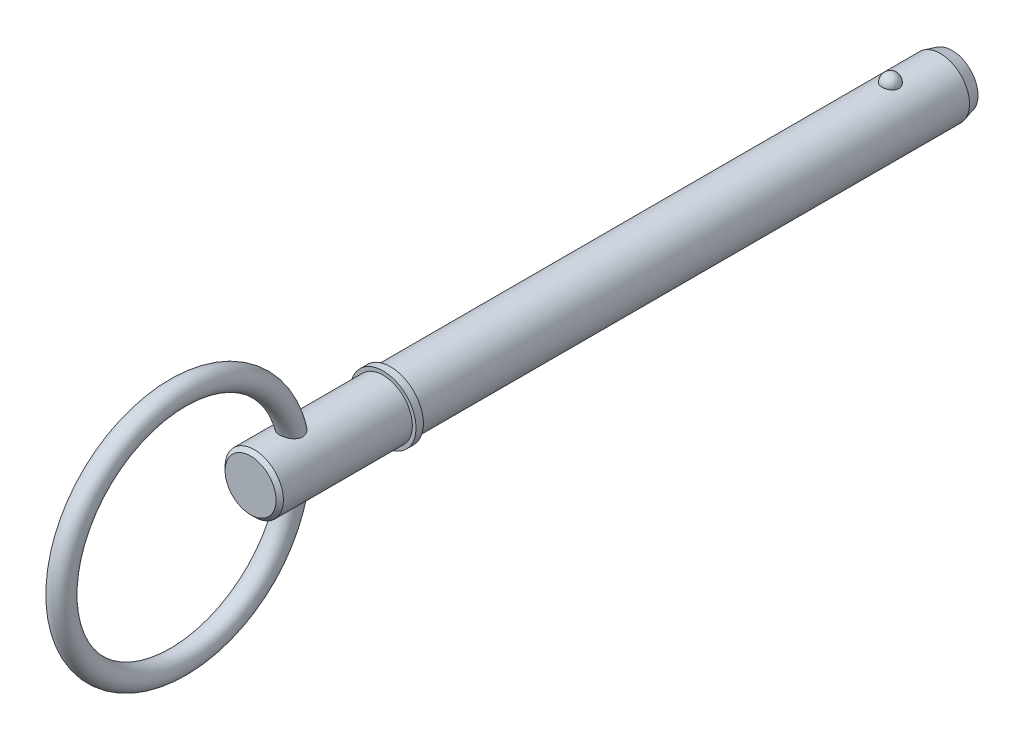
ISO-10303-21;
HEADER;
FILE_DESCRIPTION(('STEP AP214'),'2;1');
FILE_NAME('part.step','',(''),(''),'','','');
FILE_SCHEMA(('AUTOMOTIVE_DESIGN { 1 0 10303 214 1 1 1 1 }'));
ENDSEC;
DATA;
#1=APPLICATION_CONTEXT('core data for automotive mechanical design processes');
#2=APPLICATION_PROTOCOL_DEFINITION('international standard','automotive_design',2000,#1);
#3=PRODUCT_CONTEXT('',#1,'mechanical');
#4=PRODUCT('Part','Part','',(#3));
#5=PRODUCT_RELATED_PRODUCT_CATEGORY('part','',(#4));
#6=PRODUCT_DEFINITION_FORMATION('','',#4);
#7=PRODUCT_DEFINITION_CONTEXT('part definition',#1,'design');
#8=PRODUCT_DEFINITION('design','',#6,#7);
#9=PRODUCT_DEFINITION_SHAPE('','',#8);
#10=(LENGTH_UNIT() NAMED_UNIT(*) SI_UNIT(.MILLI.,.METRE.));
#11=(NAMED_UNIT(*) PLANE_ANGLE_UNIT() SI_UNIT($,.RADIAN.));
#12=(NAMED_UNIT(*) SI_UNIT($,.STERADIAN.) SOLID_ANGLE_UNIT());
#13=UNCERTAINTY_MEASURE_WITH_UNIT(LENGTH_MEASURE(1.E-05),#10,'distance_accuracy_value','');
#14=(GEOMETRIC_REPRESENTATION_CONTEXT(3) GLOBAL_UNCERTAINTY_ASSIGNED_CONTEXT((#13)) GLOBAL_UNIT_ASSIGNED_CONTEXT((#10,
#11,#12)) REPRESENTATION_CONTEXT('',''));
#15=CARTESIAN_POINT('',(0.,0.,0.));
#16=DIRECTION('',(0.,0.,1.));
#17=DIRECTION('',(1.,0.,0.));
#18=AXIS2_PLACEMENT_3D('',#15,#16,#17);
#19=CARTESIAN_POINT('',(0.,0.,66.9));
#20=DIRECTION('',(0.,0.,-1.));
#21=DIRECTION('',(-1.,0.,0.));
#22=AXIS2_PLACEMENT_3D('',#19,#20,#21);
#23=CYLINDRICAL_SURFACE('',#22,3.97);
#24=CARTESIAN_POINT('',(1.13787398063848,3.80343828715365,-1.15));
#25=CARTESIAN_POINT('',(1.13787307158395,3.80343910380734,-1.0857397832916));
#26=CARTESIAN_POINT('',(1.13264657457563,3.80501406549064,-1.02146820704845));
#27=CARTESIAN_POINT('',(1.11186534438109,3.81113760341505,-0.894749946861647));
#28=CARTESIAN_POINT('',(1.09630734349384,3.81568712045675,-0.832303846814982));
#29=CARTESIAN_POINT('',(1.05525533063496,3.82724281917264,-0.711040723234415));
#30=CARTESIAN_POINT('',(1.02976565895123,3.83424792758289,-0.652222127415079));
#31=CARTESIAN_POINT('',(0.969477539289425,3.84993235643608,-0.53981446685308));
#32=CARTESIAN_POINT('',(0.934679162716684,3.85861166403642,-0.486225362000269));
#33=CARTESIAN_POINT('',(0.856427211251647,3.87673176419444,-0.385470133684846));
#34=CARTESIAN_POINT('',(0.812928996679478,3.88617632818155,-0.338339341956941));
#35=CARTESIAN_POINT('',(0.718506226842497,3.90473543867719,-0.252134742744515));
#36=CARTESIAN_POINT('',(0.667581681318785,3.91384998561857,-0.213060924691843));
#37=CARTESIAN_POINT('',(0.559829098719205,3.93070626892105,-0.144169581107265));
#38=CARTESIAN_POINT('',(0.503019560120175,3.93845211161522,-0.114324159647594));
#39=CARTESIAN_POINT('',(0.384957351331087,3.95173781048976,-0.0645874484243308));
#40=CARTESIAN_POINT('',(0.323705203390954,3.95727792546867,-0.0446949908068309));
#41=CARTESIAN_POINT('',(0.1997490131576,3.96544869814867,-0.0157294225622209));
#42=CARTESIAN_POINT('',(0.137095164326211,3.96813298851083,-0.00645660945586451));
#43=CARTESIAN_POINT('',(0.0110617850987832,3.97048461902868,0.00167939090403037));
#44=CARTESIAN_POINT('',(-0.0523176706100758,3.97015226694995,0.000543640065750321));
#45=CARTESIAN_POINT('',(-0.176983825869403,3.96653606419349,-0.0120046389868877));
#46=CARTESIAN_POINT('',(-0.238287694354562,3.96329719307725,-0.0232605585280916));
#47=CARTESIAN_POINT('',(-0.358077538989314,3.95427494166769,-0.0555133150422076));
#48=CARTESIAN_POINT('',(-0.41656346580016,3.94849151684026,-0.0765103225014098));
#49=CARTESIAN_POINT('',(-0.529474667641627,3.9349475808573,-0.127824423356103));
#50=CARTESIAN_POINT('',(-0.583873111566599,3.92717527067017,-0.158197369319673));
#51=CARTESIAN_POINT('',(-0.686796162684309,3.9104901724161,-0.227402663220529));
#52=CARTESIAN_POINT('',(-0.735320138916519,3.90157726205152,-0.266235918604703));
#53=CARTESIAN_POINT('',(-0.826197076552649,3.88336108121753,-0.352210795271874));
#54=CARTESIAN_POINT('',(-0.868404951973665,3.87405356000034,-0.399504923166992));
#55=CARTESIAN_POINT('',(-0.944393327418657,3.85623507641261,-0.500572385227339));
#56=CARTESIAN_POINT('',(-0.978173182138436,3.84772417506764,-0.554346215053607));
#57=CARTESIAN_POINT('',(-1.036841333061,3.83233550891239,-0.667624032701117));
#58=CARTESIAN_POINT('',(-1.06161430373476,3.82547928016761,-0.727190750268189));
#59=CARTESIAN_POINT('',(-1.1010562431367,3.81431496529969,-0.849806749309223));
#60=CARTESIAN_POINT('',(-1.11572551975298,3.81000680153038,-0.912855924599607));
#61=CARTESIAN_POINT('',(-1.13455293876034,3.80444307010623,-1.04035299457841));
#62=CARTESIAN_POINT('',(-1.13875701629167,3.80317416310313,-1.10479351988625));
#63=CARTESIAN_POINT('',(-1.13668244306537,3.80379469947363,-1.23348881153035));
#64=CARTESIAN_POINT('',(-1.13040410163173,3.80568404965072,-1.29774358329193));
#65=CARTESIAN_POINT('',(-1.10758455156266,3.81238701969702,-1.42388263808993));
#66=CARTESIAN_POINT('',(-1.09109911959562,3.81718474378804,-1.48577787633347));
#67=CARTESIAN_POINT('',(-1.04831897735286,3.82915360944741,-1.6058363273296));
#68=CARTESIAN_POINT('',(-1.02202385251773,3.83632485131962,-1.66399938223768));
#69=CARTESIAN_POINT('',(-0.960087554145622,3.85229234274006,-1.77531672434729));
#70=CARTESIAN_POINT('',(-0.924393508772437,3.86109769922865,-1.82844028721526));
#71=CARTESIAN_POINT('',(-0.844617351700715,3.87932868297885,-1.92784641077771));
#72=CARTESIAN_POINT('',(-0.800534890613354,3.88875433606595,-1.97412868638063));
#73=CARTESIAN_POINT('',(-0.704909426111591,3.90722138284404,-2.05875748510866));
#74=CARTESIAN_POINT('',(-0.653336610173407,3.91626104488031,-2.09707073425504));
#75=CARTESIAN_POINT('',(-0.544251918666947,3.93290335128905,-2.16444159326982));
#76=CARTESIAN_POINT('',(-0.486740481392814,3.94050610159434,-2.19349988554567));
#77=CARTESIAN_POINT('',(-0.368186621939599,3.95333328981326,-2.24120607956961));
#78=CARTESIAN_POINT('',(-0.307200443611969,3.9585876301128,-2.25998559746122));
#79=CARTESIAN_POINT('',(-0.182787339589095,3.96627905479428,-2.28716436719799));
#80=CARTESIAN_POINT('',(-0.119360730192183,3.96871650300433,-2.29556495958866));
#81=CARTESIAN_POINT('',(0.00676344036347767,3.97048518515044,-2.30167748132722));
#82=CARTESIAN_POINT('',(0.0694499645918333,3.96987797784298,-2.299601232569));
#83=CARTESIAN_POINT('',(0.193555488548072,3.96576491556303,-2.28530777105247));
#84=CARTESIAN_POINT('',(0.254974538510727,3.96225917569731,-2.27309096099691));
#85=CARTESIAN_POINT('',(0.374550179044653,3.95274547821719,-2.2389384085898));
#86=CARTESIAN_POINT('',(0.432719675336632,3.94674835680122,-2.2170447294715));
#87=CARTESIAN_POINT('',(0.544514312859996,3.93288448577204,-2.16414952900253));
#88=CARTESIAN_POINT('',(0.598139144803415,3.92501760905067,-2.13314738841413));
#89=CARTESIAN_POINT('',(0.700284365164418,3.90809781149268,-2.06228741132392));
#90=CARTESIAN_POINT('',(0.748708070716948,3.89902775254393,-2.02229434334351));
#91=CARTESIAN_POINT('',(0.838215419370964,3.88077133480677,-1.93481443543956));
#92=CARTESIAN_POINT('',(0.879297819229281,3.87158495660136,-1.88732632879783));
#93=CARTESIAN_POINT('',(0.953804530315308,3.85391414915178,-1.78516284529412));
#94=CARTESIAN_POINT('',(0.987071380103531,3.8454460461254,-1.73036973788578));
#95=CARTESIAN_POINT('',(1.04410491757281,3.83035507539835,-1.61582422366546));
#96=CARTESIAN_POINT('',(1.06787445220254,3.82373165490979,-1.5560733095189));
#97=CARTESIAN_POINT('',(1.10358064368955,3.813570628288,-1.43904746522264));
#98=CARTESIAN_POINT('',(1.11641754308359,3.80980198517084,-1.38206535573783));
#99=CARTESIAN_POINT('',(1.13356451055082,3.80473547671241,-1.26672526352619));
#100=CARTESIAN_POINT('',(1.13787480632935,3.80343754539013,-1.20836731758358));
#101=CARTESIAN_POINT('',(1.13787398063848,3.80343828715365,-1.15));
#102=B_SPLINE_CURVE_WITH_KNOTS('',3,(#24,#25,#26,#27,#28,#29,#30,#31,#32,#33,#34,#35,#36,#37,
#38,#39,#40,#41,#42,#43,#44,#45,#46,#47,#48,#49,#50,#51,#52,#53,#54,#55,#56,#57,#58,#59,#60,#61,
#62,#63,#64,#65,#66,#67,#68,#69,#70,#71,#72,#73,#74,#75,#76,#77,#78,#79,#80,#81,#82,#83,#84,#85,
#86,#87,#88,#89,#90,#91,#92,#93,#94,#95,#96,#97,#98,#99,#100,#101),.UNSPECIFIED.,.T.,.F.,(4,2,2,
2,2,2,2,2,2,2,2,2,2,2,2,2,2,2,2,2,2,2,2,2,2,2,2,2,2,2,2,2,2,2,2,2,2,2,4),(0.,0.192571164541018,
0.385203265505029,0.577751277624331,0.770297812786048,0.963858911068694,1.15741975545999,
1.35038964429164,1.54333688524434,1.73259288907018,1.92182958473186,2.10818732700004,
2.2945483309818,2.48204164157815,2.66955507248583,2.86087083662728,3.05220124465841,
3.24590171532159,3.43959628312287,3.63243915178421,3.82527632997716,4.01706893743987,
4.20886965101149,4.40177324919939,4.59468488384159,4.78838651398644,4.9820738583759,
5.17321934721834,5.36434014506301,5.55161251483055,5.7388774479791,5.92533626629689,
6.11180776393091,6.30129785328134,6.49082000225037,6.68388392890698,6.87688993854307,
7.05180628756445,7.22671796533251),.UNSPECIFIED.);
#103=CARTESIAN_POINT('',(1.13787398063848,3.80343828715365,-1.15));
#104=VERTEX_POINT('',#103);
#105=EDGE_CURVE('E102',#104,#104,#102,.T.);
#106=ORIENTED_EDGE('',*,*,#105,.T.);
#107=EDGE_LOOP('',(#106));
#108=FACE_BOUND('',#107,.T.);
#109=CARTESIAN_POINT('',(0.,0.,-7.94399999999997));
#110=DIRECTION('',(0.,0.,-1.));
#111=DIRECTION('',(-1.,0.,0.));
#112=AXIS2_PLACEMENT_3D('',#109,#110,#111);
#113=CIRCLE('',#112,3.97);
#114=CARTESIAN_POINT('',(-3.97,0.,-7.94399999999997));
#115=VERTEX_POINT('',#114);
#116=EDGE_CURVE('E110',#115,#115,#113,.F.);
#117=ORIENTED_EDGE('',*,*,#116,.T.);
#118=EDGE_LOOP('',(#117));
#119=FACE_BOUND('',#118,.T.);
#120=CARTESIAN_POINT('',(0.,0.,66.9));
#121=DIRECTION('',(0.,0.,1.));
#122=DIRECTION('',(1.,0.,0.));
#123=AXIS2_PLACEMENT_3D('',#120,#121,#122);
#124=CIRCLE('',#123,3.97);
#125=CARTESIAN_POINT('',(3.97,0.,66.9));
#126=VERTEX_POINT('',#125);
#127=EDGE_CURVE('E108',#126,#126,#124,.T.);
#128=ORIENTED_EDGE('',*,*,#127,.F.);
#129=EDGE_LOOP('',(#128));
#130=FACE_BOUND('',#129,.T.);
#131=ADVANCED_FACE('F39',(#108,#119,#130),#23,.T.);
#132=CARTESIAN_POINT('',(0.,0.,-9.53));
#133=DIRECTION('',(0.,0.,-1.));
#134=DIRECTION('',(-1.,0.,0.));
#135=AXIS2_PLACEMENT_3D('',#132,#133,#134);
#136=PLANE('',#135);
#137=CARTESIAN_POINT('',(0.,0.,-9.53));
#138=DIRECTION('',(0.,0.,-1.));
#139=DIRECTION('',(-1.,0.,0.));
#140=AXIS2_PLACEMENT_3D('',#137,#138,#139);
#141=CIRCLE('',#140,3.54503258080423);
#142=CARTESIAN_POINT('',(-3.54503258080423,0.,-9.53));
#143=VERTEX_POINT('',#142);
#144=EDGE_CURVE('E142',#143,#143,#141,.T.);
#145=ORIENTED_EDGE('',*,*,#144,.T.);
#146=EDGE_LOOP('',(#145));
#147=FACE_BOUND('',#146,.T.);
#148=ADVANCED_FACE('F88',(#147),#136,.T.);
#149=CARTESIAN_POINT('',(0.,0.,-9.53));
#150=DIRECTION('',(0.,0.,1.));
#151=DIRECTION('',(1.,0.,0.));
#152=AXIS2_PLACEMENT_3D('',#149,#150,#151);
#153=CONICAL_SURFACE('',#152,3.54503258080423,0.261799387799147);
#154=ORIENTED_EDGE('',*,*,#116,.F.);
#155=EDGE_LOOP('',(#154));
#156=FACE_BOUND('',#155,.T.);
#157=ORIENTED_EDGE('',*,*,#144,.F.);
#158=EDGE_LOOP('',(#157));
#159=FACE_BOUND('',#158,.T.);
#160=ADVANCED_FACE('F94',(#156,#159),#153,.T.);
#161=CARTESIAN_POINT('',(0.,3.97,-1.15));
#162=DIRECTION('',(0.,1.,0.));
#163=DIRECTION('',(0.,0.,-1.));
#164=AXIS2_PLACEMENT_3D('',#161,#162,#163);
#165=SPHERICAL_SURFACE('',#164,1.15);
#166=ORIENTED_EDGE('',*,*,#105,.F.);
#167=EDGE_LOOP('',(#166));
#168=FACE_BOUND('',#167,.T.);
#169=ADVANCED_FACE('F113',(#168),#165,.T.);
#170=CARTESIAN_POINT('',(0.,0.,66.9));
#171=DIRECTION('',(0.,0.,-1.));
#172=DIRECTION('',(-1.,0.,0.));
#173=AXIS2_PLACEMENT_3D('',#170,#171,#172);
#174=PLANE('',#173);
#175=ORIENTED_EDGE('',*,*,#127,.T.);
#176=EDGE_LOOP('',(#175));
#177=FACE_BOUND('',#176,.T.);
#178=CARTESIAN_POINT('',(0.,0.,66.9));
#179=DIRECTION('',(0.,0.,-1.));
#180=DIRECTION('',(-1.,0.,0.));
#181=AXIS2_PLACEMENT_3D('',#178,#179,#180);
#182=CIRCLE('',#181,4.47);
#183=CARTESIAN_POINT('',(-4.47,0.,66.9));
#184=VERTEX_POINT('',#183);
#185=EDGE_CURVE('E109',#184,#184,#182,.T.);
#186=ORIENTED_EDGE('',*,*,#185,.T.);
#187=EDGE_LOOP('',(#186));
#188=FACE_BOUND('',#187,.T.);
#189=ADVANCED_FACE('F117',(#177,#188),#174,.T.);
#190=CARTESIAN_POINT('',(0.,0.,33.7287874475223));
#191=DIRECTION('',(0.,0.,-1.));
#192=DIRECTION('',(-1.,0.,0.));
#193=AXIS2_PLACEMENT_3D('',#190,#191,#192);
#194=CYLINDRICAL_SURFACE('',#193,4.47);
#195=CARTESIAN_POINT('',(0.,0.,67.9));
#196=DIRECTION('',(0.,0.,-1.));
#197=DIRECTION('',(-1.,0.,0.));
#198=AXIS2_PLACEMENT_3D('',#195,#196,#197);
#199=CIRCLE('',#198,4.47);
#200=CARTESIAN_POINT('',(-4.47,0.,67.9));
#201=VERTEX_POINT('',#200);
#202=EDGE_CURVE('E134',#201,#201,#199,.T.);
#203=ORIENTED_EDGE('',*,*,#202,.T.);
#204=EDGE_LOOP('',(#203));
#205=FACE_BOUND('',#204,.T.);
#206=ORIENTED_EDGE('',*,*,#185,.F.);
#207=EDGE_LOOP('',(#206));
#208=FACE_BOUND('',#207,.T.);
#209=ADVANCED_FACE('F121',(#205,#208),#194,.T.);
#210=CARTESIAN_POINT('',(0.,4.47,67.9));
#211=DIRECTION('',(0.,0.,1.));
#212=DIRECTION('',(1.,0.,0.));
#213=AXIS2_PLACEMENT_3D('',#210,#211,#212);
#214=PLANE('',#213);
#215=CARTESIAN_POINT('',(0.,0.,67.9));
#216=DIRECTION('',(0.,0.,1.));
#217=DIRECTION('',(1.,0.,0.));
#218=AXIS2_PLACEMENT_3D('',#215,#216,#217);
#219=CIRCLE('',#218,3.97);
#220=CARTESIAN_POINT('',(3.97,0.,67.9));
#221=VERTEX_POINT('',#220);
#222=EDGE_CURVE('E112',#221,#221,#219,.T.);
#223=ORIENTED_EDGE('',*,*,#222,.F.);
#224=EDGE_LOOP('',(#223));
#225=FACE_BOUND('',#224,.T.);
#226=ORIENTED_EDGE('',*,*,#202,.F.);
#227=EDGE_LOOP('',(#226));
#228=FACE_BOUND('',#227,.T.);
#229=ADVANCED_FACE('F85',(#225,#228),#214,.T.);
#230=CARTESIAN_POINT('',(0.,0.,85.95));
#231=DIRECTION('',(0.,0.,-1.));
#232=DIRECTION('',(-1.,0.,0.));
#233=AXIS2_PLACEMENT_3D('',#230,#231,#232);
#234=CYLINDRICAL_SURFACE('',#233,3.97);
#235=CARTESIAN_POINT('',(-0.740636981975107,-3.90030215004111,79.0942081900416));
#236=CARTESIAN_POINT('',(-0.667733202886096,-3.91414543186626,79.054930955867));
#237=CARTESIAN_POINT('',(-0.591347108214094,-3.92651643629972,79.0215983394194));
#238=CARTESIAN_POINT('',(-0.433709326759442,-3.94703799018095,78.9675410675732));
#239=CARTESIAN_POINT('',(-0.352458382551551,-3.95518918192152,78.9468144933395));
#240=CARTESIAN_POINT('',(-0.187320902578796,-3.96644185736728,78.9184263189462));
#241=CARTESIAN_POINT('',(-0.103433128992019,-3.9695409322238,78.9107709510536));
#242=CARTESIAN_POINT('',(0.0645297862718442,-3.97036376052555,78.9087268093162));
#243=CARTESIAN_POINT('',(0.148604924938,-3.96808759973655,78.9143378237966));
#244=CARTESIAN_POINT('',(0.313967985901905,-3.95842655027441,78.9386101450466));
#245=CARTESIAN_POINT('',(0.395270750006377,-3.95107581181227,78.9571842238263));
#246=CARTESIAN_POINT('',(0.553418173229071,-3.93204472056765,79.0068699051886));
#247=CARTESIAN_POINT('',(0.63026242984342,-3.92036397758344,79.0379826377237));
#248=CARTESIAN_POINT('',(0.777983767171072,-3.89375421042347,79.1123739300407));
#249=CARTESIAN_POINT('',(0.848809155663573,-3.8788003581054,79.1557462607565));
#250=CARTESIAN_POINT('',(0.981880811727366,-3.84727071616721,79.2536515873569));
#251=CARTESIAN_POINT('',(1.04412630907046,-3.83069478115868,79.3081855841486));
#252=CARTESIAN_POINT('',(1.15846819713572,-3.79768496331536,79.4274397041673));
#253=CARTESIAN_POINT('',(1.21053047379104,-3.78125172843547,79.4921927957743));
#254=CARTESIAN_POINT('',(1.30266807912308,-3.75050988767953,79.6301698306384));
#255=CARTESIAN_POINT('',(1.34274789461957,-3.73620048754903,79.7033905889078));
#256=CARTESIAN_POINT('',(1.40857853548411,-3.71187334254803,79.8536278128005));
#257=CARTESIAN_POINT('',(1.43477198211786,-3.70172571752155,79.9304292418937));
#258=CARTESIAN_POINT('',(1.47426417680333,-3.68617713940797,80.0877211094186));
#259=CARTESIAN_POINT('',(1.48756557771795,-3.68077520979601,80.168210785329));
#260=CARTESIAN_POINT('',(1.5011302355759,-3.67526295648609,80.3282774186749));
#261=CARTESIAN_POINT('',(1.50172918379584,-3.67501639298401,80.4078221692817));
#262=CARTESIAN_POINT('',(1.4912869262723,-3.67926498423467,80.5660010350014));
#263=CARTESIAN_POINT('',(1.48024221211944,-3.68376156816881,80.6446348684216));
#264=CARTESIAN_POINT('',(1.44631002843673,-3.69722026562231,80.8039961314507));
#265=CARTESIAN_POINT('',(1.42273446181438,-3.7064405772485,80.8845537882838));
#266=CARTESIAN_POINT('',(1.36440745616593,-3.72830487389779,81.0410229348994));
#267=CARTESIAN_POINT('',(1.32965006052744,-3.74095068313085,81.1169319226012));
#268=CARTESIAN_POINT('',(1.244983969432,-3.77003365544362,81.2715893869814));
#269=CARTESIAN_POINT('',(1.19374759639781,-3.78674477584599,81.3495625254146));
#270=CARTESIAN_POINT('',(1.07927226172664,-3.82094743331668,81.496060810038));
#271=CARTESIAN_POINT('',(1.0160234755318,-3.83843960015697,81.5645781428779));
#272=CARTESIAN_POINT('',(0.875824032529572,-3.87288453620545,81.6922425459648));
#273=CARTESIAN_POINT('',(0.798445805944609,-3.88979192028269,81.7509375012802));
#274=CARTESIAN_POINT('',(0.633271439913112,-3.92005992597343,81.8524486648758));
#275=CARTESIAN_POINT('',(0.54549210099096,-3.9334261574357,81.8952900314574));
#276=CARTESIAN_POINT('',(0.374503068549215,-3.9531041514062,81.9573026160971));
#277=CARTESIAN_POINT('',(0.29225018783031,-3.96011991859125,81.9788718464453));
#278=CARTESIAN_POINT('',(0.124887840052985,-3.96891507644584,82.0058171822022));
#279=CARTESIAN_POINT('',(0.0397822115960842,-3.97070123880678,82.011214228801));
#280=CARTESIAN_POINT('',(-0.116598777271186,-3.96893737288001,82.0058414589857));
#281=CARTESIAN_POINT('',(-0.187977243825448,-3.96616998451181,81.9974431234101));
#282=CARTESIAN_POINT('',(-0.328224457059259,-3.95703238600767,81.9693459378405));
#283=CARTESIAN_POINT('',(-0.397092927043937,-3.95066177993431,81.9496458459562));
#284=CARTESIAN_POINT('',(-0.530777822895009,-3.93493622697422,81.900002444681));
#285=CARTESIAN_POINT('',(-0.595585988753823,-3.92557541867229,81.8700390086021));
#286=CARTESIAN_POINT('',(-0.719890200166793,-3.904694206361,81.8012213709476));
#287=CARTESIAN_POINT('',(-0.779384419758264,-3.89317306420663,81.7623641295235));
#288=CARTESIAN_POINT('',(-0.900171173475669,-3.86715924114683,81.6711356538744));
#289=CARTESIAN_POINT('',(-0.960570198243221,-3.85247602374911,81.6176378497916));
#290=CARTESIAN_POINT('',(-1.07286582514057,-3.82272677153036,81.5024377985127));
#291=CARTESIAN_POINT('',(-1.12475588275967,-3.8076604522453,81.4407293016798));
#292=CARTESIAN_POINT('',(-1.22682603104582,-3.7761197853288,81.3003072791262));
#293=CARTESIAN_POINT('',(-1.27547686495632,-3.75979238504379,81.2204426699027));
#294=CARTESIAN_POINT('',(-1.35956460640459,-3.73021138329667,81.0534537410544));
#295=CARTESIAN_POINT('',(-1.39499536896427,-3.71695921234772,80.9663260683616));
#296=CARTESIAN_POINT('',(-1.45224550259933,-3.6949785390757,80.7837644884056));
#297=CARTESIAN_POINT('',(-1.47355906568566,-3.68641985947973,80.6881485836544));
#298=CARTESIAN_POINT('',(-1.49891316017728,-3.67618897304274,80.4943060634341));
#299=CARTESIAN_POINT('',(-1.50297414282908,-3.67450861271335,80.3960826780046));
#300=CARTESIAN_POINT('',(-1.49322338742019,-3.67847743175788,80.2115204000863));
#301=CARTESIAN_POINT('',(-1.48132891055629,-3.68334053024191,80.125062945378));
#302=CARTESIAN_POINT('',(-1.44277978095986,-3.69860964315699,79.9560202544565));
#303=CARTESIAN_POINT('',(-1.41613105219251,-3.70901343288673,79.8734334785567));
#304=CARTESIAN_POINT('',(-1.35164005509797,-3.73296583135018,79.7217432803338));
#305=CARTESIAN_POINT('',(-1.31494998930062,-3.74616939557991,79.6520907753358));
#306=CARTESIAN_POINT('',(-1.23078033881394,-3.77465882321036,79.5201142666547));
#307=CARTESIAN_POINT('',(-1.18329862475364,-3.7899450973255,79.4577917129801));
#308=CARTESIAN_POINT('',(-1.07555346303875,-3.82196646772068,79.338244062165));
#309=CARTESIAN_POINT('',(-1.01467770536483,-3.83873247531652,79.2815789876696));
#310=CARTESIAN_POINT('',(-0.883925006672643,-3.87093079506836,79.179334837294));
#311=CARTESIAN_POINT('',(-0.81404638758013,-3.88636285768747,79.1337578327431));
#312=CARTESIAN_POINT('',(-0.740636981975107,-3.90030215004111,79.0942081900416));
#313=B_SPLINE_CURVE_WITH_KNOTS('',3,(#235,#236,#237,#238,#239,#240,#241,#242,#243,#244,#245,
#246,#247,#248,#249,#250,#251,#252,#253,#254,#255,#256,#257,#258,#259,#260,#261,#262,#263,#264,
#265,#266,#267,#268,#269,#270,#271,#272,#273,#274,#275,#276,#277,#278,#279,#280,#281,#282,#283,
#284,#285,#286,#287,#288,#289,#290,#291,#292,#293,#294,#295,#296,#297,#298,#299,#300,#301,#302,
#303,#304,#305,#306,#307,#308,#309,#310,#311,#312),.UNSPECIFIED.,.T.,.F.,(4,2,2,2,2,2,2,2,2,2,2,
2,2,2,2,2,2,2,2,2,2,2,2,2,2,2,2,2,2,2,2,2,2,2,2,2,2,2,4),(0.,0.251585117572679,
0.503131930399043,0.754798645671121,1.00646134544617,1.25644674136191,1.50645467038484,
1.75842915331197,2.01042624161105,2.26325358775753,2.51598614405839,2.76008726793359,
3.00413815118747,3.24173115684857,3.47939577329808,3.7317117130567,3.98416228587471,
4.26728153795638,4.55063334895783,4.8446962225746,5.13829042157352,5.39265192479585,
5.6466839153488,5.86142364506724,6.07618697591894,6.29137389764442,6.50663447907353,
6.75172833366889,6.99700982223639,7.28055118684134,7.56422418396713,7.85757857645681,
8.15058512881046,8.41135406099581,8.67201836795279,8.91039015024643,9.14880900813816,
9.40209172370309,9.65542171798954),.UNSPECIFIED.);
#314=CARTESIAN_POINT('',(-0.740636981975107,-3.90030215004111,79.0942081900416));
#315=VERTEX_POINT('',#314);
#316=EDGE_CURVE('E10',#315,#315,#313,.T.);
#317=ORIENTED_EDGE('',*,*,#316,.F.);
#318=EDGE_LOOP('',(#317));
#319=FACE_BOUND('',#318,.T.);
#320=CARTESIAN_POINT('',(-0.740636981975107,3.90030215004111,79.0942081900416));
#321=CARTESIAN_POINT('',(-0.813118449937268,3.88653971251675,79.1332571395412));
#322=CARTESIAN_POINT('',(-0.882149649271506,3.8713229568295,79.1781781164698));
#323=CARTESIAN_POINT('',(-1.01146335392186,3.83956738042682,79.2788428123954));
#324=CARTESIAN_POINT('',(-1.07174704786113,3.82302873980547,79.3345850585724));
#325=CARTESIAN_POINT('',(-1.18196955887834,3.79040422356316,79.4557938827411));
#326=CARTESIAN_POINT('',(-1.23189269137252,3.77431906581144,79.5212749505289));
#327=CARTESIAN_POINT('',(-1.31978443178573,3.74449359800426,79.6602948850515));
#328=CARTESIAN_POINT('',(-1.35775694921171,3.73075252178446,79.7338311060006));
#329=CARTESIAN_POINT('',(-1.41974909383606,3.7075981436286,79.8847128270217));
#330=CARTESIAN_POINT('',(-1.44413408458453,3.69807309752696,79.9618910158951));
#331=CARTESIAN_POINT('',(-1.4800654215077,3.6838411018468,80.119590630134));
#332=CARTESIAN_POINT('',(-1.49161368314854,3.67913343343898,80.2001115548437));
#333=CARTESIAN_POINT('',(-1.50187378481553,3.67495610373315,80.3602618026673));
#334=CARTESIAN_POINT('',(-1.50086613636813,3.67537197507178,80.4398709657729));
#335=CARTESIAN_POINT('',(-1.48728932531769,3.68088569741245,80.5979172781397));
#336=CARTESIAN_POINT('',(-1.47471654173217,3.68598501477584,80.6763540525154));
#337=CARTESIAN_POINT('',(-1.43761932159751,3.70061780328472,80.8355940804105));
#338=CARTESIAN_POINT('',(-1.41233843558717,3.71042990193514,80.9161940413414));
#339=CARTESIAN_POINT('',(-1.35057314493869,3.73335405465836,81.0724850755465));
#340=CARTESIAN_POINT('',(-1.31408239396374,3.74646797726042,81.1481733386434));
#341=CARTESIAN_POINT('',(-1.2257172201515,3.77636700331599,81.3020428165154));
#342=CARTESIAN_POINT('',(-1.17251505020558,3.79340436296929,81.3794161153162));
#343=CARTESIAN_POINT('',(-1.05406412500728,3.82800923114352,81.5243069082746));
#344=CARTESIAN_POINT('',(-0.988806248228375,3.84557713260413,81.5918168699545));
#345=CARTESIAN_POINT('',(-0.845287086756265,3.87968695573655,81.7162211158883));
#346=CARTESIAN_POINT('',(-0.766724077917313,3.89618874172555,81.7727822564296));
#347=CARTESIAN_POINT('',(-0.599538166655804,3.92537936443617,81.8696962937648));
#348=CARTESIAN_POINT('',(-0.510933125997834,3.93807482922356,81.9100774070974));
#349=CARTESIAN_POINT('',(-0.339677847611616,3.95624165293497,81.9670085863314));
#350=CARTESIAN_POINT('',(-0.257968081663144,3.96248273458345,81.9861280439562));
#351=CARTESIAN_POINT('',(-0.0922002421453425,3.96979198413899,82.0084736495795));
#352=CARTESIAN_POINT('',(-0.00814495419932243,3.97086604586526,82.0117179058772));
#353=CARTESIAN_POINT('',(0.146484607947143,3.96793776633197,82.0027977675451));
#354=CARTESIAN_POINT('',(0.217212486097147,3.96466338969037,81.9928433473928));
#355=CARTESIAN_POINT('',(0.355938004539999,3.95462310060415,81.9618888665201));
#356=CARTESIAN_POINT('',(0.423935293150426,3.94785673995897,81.940887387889));
#357=CARTESIAN_POINT('',(0.556534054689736,3.93137424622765,81.8886148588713));
#358=CARTESIAN_POINT('',(0.621075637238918,3.92161865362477,81.8572059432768));
#359=CARTESIAN_POINT('',(0.744663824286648,3.90004074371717,81.7855756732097));
#360=CARTESIAN_POINT('',(0.803708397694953,3.88821766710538,81.7453510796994));
#361=CARTESIAN_POINT('',(0.923664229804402,3.86161149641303,81.6510569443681));
#362=CARTESIAN_POINT('',(0.983622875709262,3.84664723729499,81.5958282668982));
#363=CARTESIAN_POINT('',(1.09477654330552,3.816501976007,81.4771942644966));
#364=CARTESIAN_POINT('',(1.14596459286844,3.80132081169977,81.4137825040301));
#365=CARTESIAN_POINT('',(1.24603510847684,3.76980809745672,81.2699890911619));
#366=CARTESIAN_POINT('',(1.29338223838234,3.753652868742,81.1884933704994));
#367=CARTESIAN_POINT('',(1.37450267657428,3.72471527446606,81.0183960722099));
#368=CARTESIAN_POINT('',(1.40827109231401,3.71193412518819,80.9297919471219));
#369=CARTESIAN_POINT('',(1.46140533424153,3.6913461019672,80.7455436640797));
#370=CARTESIAN_POINT('',(1.48042991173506,3.6836576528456,80.6497859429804));
#371=CARTESIAN_POINT('',(1.50115029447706,3.67526750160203,80.4561286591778));
#372=CARTESIAN_POINT('',(1.50286713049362,3.67455732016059,80.3582318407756));
#373=CARTESIAN_POINT('',(1.48878143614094,3.68028077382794,80.1752085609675));
#374=CARTESIAN_POINT('',(1.47496153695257,3.68590609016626,80.0899028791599));
#375=CARTESIAN_POINT('',(1.43287242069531,3.70247002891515,79.9234763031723));
#376=CARTESIAN_POINT('',(1.40460762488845,3.7134070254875,79.8423541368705));
#377=CARTESIAN_POINT('',(1.33714680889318,3.7381964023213,79.6931046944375));
#378=CARTESIAN_POINT('',(1.29898330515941,3.7517524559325,79.6244572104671));
#379=CARTESIAN_POINT('',(1.21206000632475,3.78072797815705,79.4946829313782));
#380=CARTESIAN_POINT('',(1.16329942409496,3.79614758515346,79.4335566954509));
#381=CARTESIAN_POINT('',(1.05526740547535,3.82760231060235,79.3188656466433));
#382=CARTESIAN_POINT('',(0.995782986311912,3.84364346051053,79.2655033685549));
#383=CARTESIAN_POINT('',(0.868651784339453,3.8743538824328,79.1690998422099));
#384=CARTESIAN_POINT('',(0.801003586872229,3.88902291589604,79.1260603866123));
#385=CARTESIAN_POINT('',(0.6566964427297,3.91602140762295,79.0497891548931));
#386=CARTESIAN_POINT('',(0.579799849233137,3.92824686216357,79.0169691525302));
#387=CARTESIAN_POINT('',(0.421219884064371,3.94839960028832,78.9640374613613));
#388=CARTESIAN_POINT('',(0.339536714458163,3.95632706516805,78.9439252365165));
#389=CARTESIAN_POINT('',(0.173681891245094,3.96706909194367,78.9168661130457));
#390=CARTESIAN_POINT('',(0.0895101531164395,3.96988347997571,78.9099196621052));
#391=CARTESIAN_POINT('',(-0.0788915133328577,3.97010941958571,78.9093589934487));
#392=CARTESIAN_POINT('',(-0.16312144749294,3.96752031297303,78.9157463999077));
#393=CARTESIAN_POINT('',(-0.332911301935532,3.9569711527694,78.9422872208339));
#394=CARTESIAN_POINT('',(-0.418363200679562,3.9487768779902,78.9630414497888));
#395=CARTESIAN_POINT('',(-0.584033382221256,3.92769448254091,79.0184250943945));
#396=CARTESIAN_POINT('',(-0.664251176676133,3.91480592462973,79.0530558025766));
#397=CARTESIAN_POINT('',(-0.740636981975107,3.90030215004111,79.0942081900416));
#398=B_SPLINE_CURVE_WITH_KNOTS('',3,(#320,#321,#322,#323,#324,#325,#326,#327,#328,#329,#330,
#331,#332,#333,#334,#335,#336,#337,#338,#339,#340,#341,#342,#343,#344,#345,#346,#347,#348,#349,
#350,#351,#352,#353,#354,#355,#356,#357,#358,#359,#360,#361,#362,#363,#364,#365,#366,#367,#368,
#369,#370,#371,#372,#373,#374,#375,#376,#377,#378,#379,#380,#381,#382,#383,#384,#385,#386,#387,
#388,#389,#390,#391,#392,#393,#394,#395,#396,#397),.UNSPECIFIED.,.T.,.F.,(4,2,2,2,2,2,2,2,2,2,2,
2,2,2,2,2,2,2,2,2,2,2,2,2,2,2,2,2,2,2,2,2,2,2,2,2,2,2,4),(0.,0.250115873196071,
0.500197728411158,0.750655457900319,1.00103116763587,1.24430196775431,1.48753646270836,
1.72534678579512,1.96323159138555,2.2173360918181,2.47158471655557,2.75662009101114,
3.0418720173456,3.33477180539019,3.62715855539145,3.87803518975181,4.12862559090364,
4.34211896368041,4.55563974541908,4.7721103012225,4.98866052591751,5.23635199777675,
5.48423946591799,5.76983687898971,6.05553710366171,6.34766729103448,6.63944246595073,
6.8978234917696,7.15612548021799,7.39414671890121,7.63218564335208,7.87561406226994,
8.11908472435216,8.37137533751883,8.62365530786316,8.87594385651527,9.12826313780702,
9.39182737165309,9.65541616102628),.UNSPECIFIED.);
#399=CARTESIAN_POINT('',(-0.740636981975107,3.90030215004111,79.0942081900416));
#400=VERTEX_POINT('',#399);
#401=EDGE_CURVE('E51',#400,#400,#398,.T.);
#402=ORIENTED_EDGE('',*,*,#401,.F.);
#403=EDGE_LOOP('',(#402));
#404=FACE_BOUND('',#403,.T.);
#405=CARTESIAN_POINT('',(0.,0.,85.45));
#406=DIRECTION('',(0.,0.,-1.));
#407=DIRECTION('',(-1.,0.,0.));
#408=AXIS2_PLACEMENT_3D('',#405,#406,#407);
#409=CIRCLE('',#408,3.97);
#410=CARTESIAN_POINT('',(-3.97,0.,85.45));
#411=VERTEX_POINT('',#410);
#412=EDGE_CURVE('E64',#411,#411,#409,.T.);
#413=ORIENTED_EDGE('',*,*,#412,.T.);
#414=EDGE_LOOP('',(#413));
#415=FACE_BOUND('',#414,.T.);
#416=ORIENTED_EDGE('',*,*,#222,.T.);
#417=EDGE_LOOP('',(#416));
#418=FACE_BOUND('',#417,.T.);
#419=ADVANCED_FACE('F69',(#319,#404,#415,#418),#234,.T.);
#420=CARTESIAN_POINT('',(0.,0.,85.95));
#421=DIRECTION('',(0.,0.,-1.));
#422=DIRECTION('',(-1.,0.,0.));
#423=AXIS2_PLACEMENT_3D('',#420,#421,#422);
#424=PLANE('',#423);
#425=CARTESIAN_POINT('',(0.,0.,85.95));
#426=DIRECTION('',(0.,0.,-1.));
#427=DIRECTION('',(-1.,0.,0.));
#428=AXIS2_PLACEMENT_3D('',#425,#426,#427);
#429=CIRCLE('',#428,3.46999999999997);
#430=CARTESIAN_POINT('',(-3.46999999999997,0.,85.95));
#431=VERTEX_POINT('',#430);
#432=EDGE_CURVE('E58',#431,#431,#429,.F.);
#433=ORIENTED_EDGE('',*,*,#432,.T.);
#434=EDGE_LOOP('',(#433));
#435=FACE_BOUND('',#434,.T.);
#436=ADVANCED_FACE('F76',(#435),#424,.F.);
#437=CARTESIAN_POINT('',(0.,0.,85.45));
#438=DIRECTION('',(0.,0.,-1.));
#439=DIRECTION('',(-1.,0.,0.));
#440=AXIS2_PLACEMENT_3D('',#437,#438,#439);
#441=CONICAL_SURFACE('',#440,3.97,0.785398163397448);
#442=ORIENTED_EDGE('',*,*,#432,.F.);
#443=EDGE_LOOP('',(#442));
#444=FACE_BOUND('',#443,.T.);
#445=ORIENTED_EDGE('',*,*,#412,.F.);
#446=EDGE_LOOP('',(#445));
#447=FACE_BOUND('',#446,.T.);
#448=ADVANCED_FACE('F41',(#444,#447),#441,.T.);
#449=CARTESIAN_POINT('',(0.,0.,95.825));
#450=DIRECTION('',(1.,0.,0.));
#451=DIRECTION('',(0.,0.,-1.));
#452=AXIS2_PLACEMENT_3D('',#449,#450,#451);
#453=TOROIDAL_SURFACE('',#452,15.875,1.5);
#454=ORIENTED_EDGE('',*,*,#316,.T.);
#455=EDGE_LOOP('',(#454));
#456=FACE_BOUND('',#455,.T.);
#457=ORIENTED_EDGE('',*,*,#401,.T.);
#458=EDGE_LOOP('',(#457));
#459=FACE_BOUND('',#458,.T.);
#460=ADVANCED_FACE('F73',(#456,#459),#453,.T.);
#461=CLOSED_SHELL('',(#131,#148,#160,#169,#189,#209,#229,#419,#436,#448,#460));
#462=MANIFOLD_SOLID_BREP('B2',#461);
#463=ADVANCED_BREP_SHAPE_REPRESENTATION('',(#18,#462),#14);
#464=SHAPE_DEFINITION_REPRESENTATION(#9,#463);
ENDSEC;
END-ISO-10303-21;
